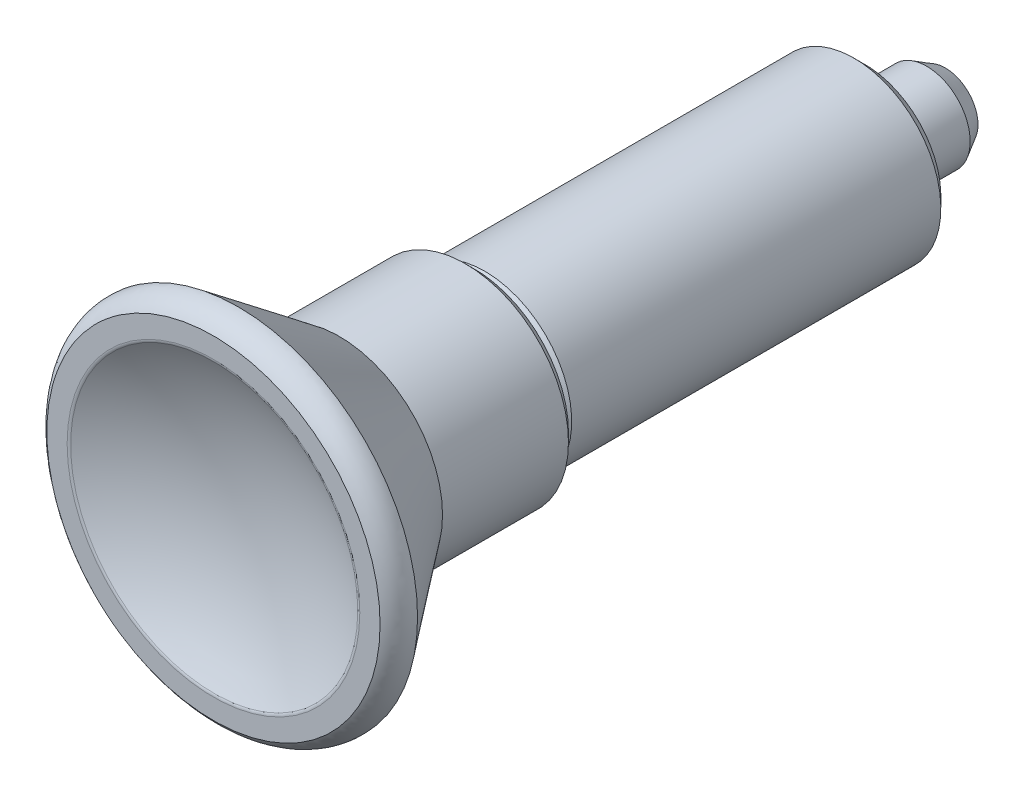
ISO-10303-21;
HEADER;
FILE_DESCRIPTION(('STEP AP214'),'2;1');
FILE_NAME('part.step','',(''),(''),'','','');
FILE_SCHEMA(('AUTOMOTIVE_DESIGN { 1 0 10303 214 1 1 1 1 }'));
ENDSEC;
DATA;
#1=APPLICATION_CONTEXT('core data for automotive mechanical design processes');
#2=APPLICATION_PROTOCOL_DEFINITION('international standard','automotive_design',2000,#1);
#3=PRODUCT_CONTEXT('',#1,'mechanical');
#4=PRODUCT('Part','Part','',(#3));
#5=PRODUCT_RELATED_PRODUCT_CATEGORY('part','',(#4));
#6=PRODUCT_DEFINITION_FORMATION('','',#4);
#7=PRODUCT_DEFINITION_CONTEXT('part definition',#1,'design');
#8=PRODUCT_DEFINITION('design','',#6,#7);
#9=PRODUCT_DEFINITION_SHAPE('','',#8);
#10=(LENGTH_UNIT() NAMED_UNIT(*) SI_UNIT(.MILLI.,.METRE.));
#11=(NAMED_UNIT(*) PLANE_ANGLE_UNIT() SI_UNIT($,.RADIAN.));
#12=(NAMED_UNIT(*) SI_UNIT($,.STERADIAN.) SOLID_ANGLE_UNIT());
#13=UNCERTAINTY_MEASURE_WITH_UNIT(LENGTH_MEASURE(1.E-05),#10,'distance_accuracy_value','');
#14=(GEOMETRIC_REPRESENTATION_CONTEXT(3) GLOBAL_UNCERTAINTY_ASSIGNED_CONTEXT((#13)) GLOBAL_UNIT_ASSIGNED_CONTEXT((#10,
#11,#12)) REPRESENTATION_CONTEXT('',''));
#15=CARTESIAN_POINT('',(0.,0.,0.));
#16=DIRECTION('',(0.,0.,1.));
#17=DIRECTION('',(1.,0.,0.));
#18=AXIS2_PLACEMENT_3D('',#15,#16,#17);
#19=CARTESIAN_POINT('',(4.75462086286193E-11,-3.93907129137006E-10,4.89046303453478E-10));
#20=DIRECTION('',(-0.923728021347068,-0.383049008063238,0.));
#21=DIRECTION('',(0.,0.,-1.));
#22=AXIS2_PLACEMENT_3D('',#19,#20,#21);
#23=SPHERICAL_SURFACE('',#22,8.);
#24=CARTESIAN_POINT('',(0.,0.,-7.41135340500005));
#25=DIRECTION('',(0.,0.,1.));
#26=DIRECTION('',(0.923728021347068,0.383049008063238,0.));
#27=AXIS2_PLACEMENT_3D('',#24,#25,#26);
#28=CIRCLE('',#27,3.011949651);
#29=CARTESIAN_POINT('',(2.78222229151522,1.15372432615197,-7.41135340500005));
#30=VERTEX_POINT('',#29);
#31=EDGE_CURVE('E16',#30,#30,#28,.T.);
#32=ORIENTED_EDGE('',*,*,#31,.F.);
#33=EDGE_LOOP('',(#32));
#34=FACE_BOUND('',#33,.T.);
#35=ADVANCED_FACE('F12',(#34),#23,.T.);
#36=CARTESIAN_POINT('',(0.,0.,-7.41135340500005));
#37=DIRECTION('',(0.,0.,1.));
#38=DIRECTION('',(0.923728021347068,0.383049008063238,0.));
#39=AXIS2_PLACEMENT_3D('',#36,#37,#38);
#40=CONICAL_SURFACE('',#39,3.011949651,0.523598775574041);
#41=ORIENTED_EDGE('',*,*,#31,.T.);
#42=EDGE_LOOP('',(#41));
#43=FACE_BOUND('',#42,.T.);
#44=CARTESIAN_POINT('',(0.,0.,-5.7));
#45=DIRECTION('',(0.,0.,-1.));
#46=DIRECTION('',(-0.923728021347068,-0.383049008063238,0.));
#47=AXIS2_PLACEMENT_3D('',#44,#45,#46);
#48=CIRCLE('',#47,4.);
#49=CARTESIAN_POINT('',(-3.69491208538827,-1.53219603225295,-5.7));
#50=VERTEX_POINT('',#49);
#51=EDGE_CURVE('E29',#50,#50,#48,.F.);
#52=ORIENTED_EDGE('',*,*,#51,.F.);
#53=EDGE_LOOP('',(#52));
#54=FACE_BOUND('',#53,.T.);
#55=ADVANCED_FACE('F83',(#43,#54),#40,.T.);
#56=CARTESIAN_POINT('',(0.,0.,0.));
#57=DIRECTION('',(0.,0.,-1.));
#58=DIRECTION('',(-0.923728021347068,-0.383049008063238,0.));
#59=AXIS2_PLACEMENT_3D('',#56,#57,#58);
#60=CYLINDRICAL_SURFACE('',#59,4.);
#61=CARTESIAN_POINT('',(0.,0.,0.));
#62=DIRECTION('',(0.,0.,-1.));
#63=DIRECTION('',(-0.923728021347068,-0.383049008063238,0.));
#64=AXIS2_PLACEMENT_3D('',#61,#62,#63);
#65=CIRCLE('',#64,4.);
#66=CARTESIAN_POINT('',(-3.69491208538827,-1.53219603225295,0.));
#67=VERTEX_POINT('',#66);
#68=EDGE_CURVE('E33',#67,#67,#65,.F.);
#69=ORIENTED_EDGE('',*,*,#68,.F.);
#70=EDGE_LOOP('',(#69));
#71=FACE_BOUND('',#70,.T.);
#72=ORIENTED_EDGE('',*,*,#51,.T.);
#73=EDGE_LOOP('',(#72));
#74=FACE_BOUND('',#73,.T.);
#75=ADVANCED_FACE('F89',(#71,#74),#60,.T.);
#76=CARTESIAN_POINT('',(9.26654561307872,-3.8526867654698,0.));
#77=DIRECTION('',(0.,0.,-1.));
#78=DIRECTION('',(-0.923728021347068,-0.383049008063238,0.));
#79=AXIS2_PLACEMENT_3D('',#76,#77,#78);
#80=PLANE('',#79);
#81=ORIENTED_EDGE('',*,*,#68,.T.);
#82=EDGE_LOOP('',(#81));
#83=FACE_BOUND('',#82,.T.);
#84=CARTESIAN_POINT('',(0.,0.,0.));
#85=DIRECTION('',(0.,0.,1.));
#86=DIRECTION('',(0.923728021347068,0.383049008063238,0.));
#87=AXIS2_PLACEMENT_3D('',#84,#85,#86);
#88=CIRCLE('',#87,7.);
#89=CARTESIAN_POINT('',(6.46609614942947,2.68134305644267,0.));
#90=VERTEX_POINT('',#89);
#91=EDGE_CURVE('E31',#90,#90,#88,.T.);
#92=ORIENTED_EDGE('',*,*,#91,.F.);
#93=EDGE_LOOP('',(#92));
#94=FACE_BOUND('',#93,.T.);
#95=ADVANCED_FACE('F92',(#83,#94),#80,.T.);
#96=CARTESIAN_POINT('',(0.,0.,0.));
#97=DIRECTION('',(0.,0.,1.));
#98=DIRECTION('',(0.923728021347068,0.383049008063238,0.));
#99=AXIS2_PLACEMENT_3D('',#96,#97,#98);
#100=CONICAL_SURFACE('',#99,7.,0.785398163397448);
#101=CARTESIAN_POINT('',(0.,0.,1.));
#102=DIRECTION('',(0.,0.,-1.));
#103=DIRECTION('',(-0.923728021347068,-0.383049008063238,0.));
#104=AXIS2_PLACEMENT_3D('',#101,#102,#103);
#105=CIRCLE('',#104,8.);
#106=CARTESIAN_POINT('',(-7.38982417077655,-3.0643920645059,0.999999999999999));
#107=VERTEX_POINT('',#106);
#108=EDGE_CURVE('E25',#107,#107,#105,.F.);
#109=ORIENTED_EDGE('',*,*,#108,.F.);
#110=EDGE_LOOP('',(#109));
#111=FACE_BOUND('',#110,.T.);
#112=ORIENTED_EDGE('',*,*,#91,.T.);
#113=EDGE_LOOP('',(#112));
#114=FACE_BOUND('',#113,.T.);
#115=ADVANCED_FACE('F94',(#111,#114),#100,.T.);
#116=CARTESIAN_POINT('',(0.,0.,35.));
#117=DIRECTION('',(0.,0.,-1.));
#118=DIRECTION('',(-0.923728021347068,-0.383049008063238,0.));
#119=AXIS2_PLACEMENT_3D('',#116,#117,#118);
#120=CYLINDRICAL_SURFACE('',#119,8.);
#121=ORIENTED_EDGE('',*,*,#108,.T.);
#122=EDGE_LOOP('',(#121));
#123=FACE_BOUND('',#122,.T.);
#124=CARTESIAN_POINT('',(0.,0.,35.));
#125=DIRECTION('',(0.,0.,-1.));
#126=DIRECTION('',(-0.923728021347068,-0.383049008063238,0.));
#127=AXIS2_PLACEMENT_3D('',#124,#125,#126);
#128=CIRCLE('',#127,8.);
#129=CARTESIAN_POINT('',(-7.38982417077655,-3.0643920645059,35.));
#130=VERTEX_POINT('',#129);
#131=EDGE_CURVE('E20',#130,#130,#128,.F.);
#132=ORIENTED_EDGE('',*,*,#131,.F.);
#133=EDGE_LOOP('',(#132));
#134=FACE_BOUND('',#133,.T.);
#135=ADVANCED_FACE('F97',(#123,#134),#120,.T.);
#136=CARTESIAN_POINT('',(0.,0.,36.));
#137=DIRECTION('',(0.,0.,-1.));
#138=DIRECTION('',(0.383049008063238,-0.923728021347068,0.));
#139=AXIS2_PLACEMENT_3D('',#136,#137,#138);
#140=CONICAL_SURFACE('',#139,7.,0.785398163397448);
#141=ORIENTED_EDGE('',*,*,#131,.T.);
#142=EDGE_LOOP('',(#141));
#143=FACE_BOUND('',#142,.T.);
#144=CARTESIAN_POINT('',(0.,0.,36.));
#145=DIRECTION('',(0.,0.,-1.));
#146=DIRECTION('',(0.383049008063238,-0.923728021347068,0.));
#147=AXIS2_PLACEMENT_3D('',#144,#145,#146);
#148=CIRCLE('',#147,7.);
#149=CARTESIAN_POINT('',(2.68134305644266,-6.46609614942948,36.));
#150=VERTEX_POINT('',#149);
#151=EDGE_CURVE('E8',#150,#150,#148,.T.);
#152=ORIENTED_EDGE('',*,*,#151,.T.);
#153=EDGE_LOOP('',(#152));
#154=FACE_BOUND('',#153,.T.);
#155=ADVANCED_FACE('F101',(#143,#154),#140,.T.);
#156=CARTESIAN_POINT('',(-7.29516712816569E-13,0.,82.3153369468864));
#157=DIRECTION('',(0.,0.,-1.));
#158=DIRECTION('',(1.,0.,0.));
#159=AXIS2_PLACEMENT_3D('',#156,#157,#158);
#160=SPHERICAL_SURFACE('',#159,25.9999999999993);
#161=CARTESIAN_POINT('',(0.,0.,59.9304780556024));
#162=DIRECTION('',(0.,0.,-1.));
#163=DIRECTION('',(1.,0.,0.));
#164=AXIS2_PLACEMENT_3D('',#161,#162,#163);
#165=CIRCLE('',#164,13.2256603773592);
#166=CARTESIAN_POINT('',(13.2256603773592,0.,59.9304780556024));
#167=VERTEX_POINT('',#166);
#168=EDGE_CURVE('E74',#167,#167,#165,.T.);
#169=ORIENTED_EDGE('',*,*,#168,.F.);
#170=EDGE_LOOP('',(#169));
#171=FACE_BOUND('',#170,.T.);
#172=ADVANCED_FACE('F85',(#171),#160,.F.);
#173=CARTESIAN_POINT('',(0.,0.,59.5000000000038));
#174=DIRECTION('',(0.,0.,-1.));
#175=DIRECTION('',(-1.,0.,0.));
#176=AXIS2_PLACEMENT_3D('',#173,#174,#175);
#177=TOROIDAL_SURFACE('',#176,13.4799999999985,0.499999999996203);
#178=ORIENTED_EDGE('',*,*,#168,.T.);
#179=EDGE_LOOP('',(#178));
#180=FACE_BOUND('',#179,.T.);
#181=CARTESIAN_POINT('',(0.,0.,60.));
#182=DIRECTION('',(0.,0.,-1.));
#183=DIRECTION('',(1.,0.,0.));
#184=AXIS2_PLACEMENT_3D('',#181,#182,#183);
#185=CIRCLE('',#184,13.48);
#186=CARTESIAN_POINT('',(13.48,0.,60.));
#187=VERTEX_POINT('',#186);
#188=EDGE_CURVE('E67',#187,#187,#185,.T.);
#189=ORIENTED_EDGE('',*,*,#188,.F.);
#190=EDGE_LOOP('',(#189));
#191=FACE_BOUND('',#190,.T.);
#192=ADVANCED_FACE('F14',(#180,#191),#177,.T.);
#193=CARTESIAN_POINT('',(-16.885,-16.885,60.));
#194=DIRECTION('',(0.,0.,1.));
#195=DIRECTION('',(1.,0.,0.));
#196=AXIS2_PLACEMENT_3D('',#193,#194,#195);
#197=PLANE('',#196);
#198=CARTESIAN_POINT('',(0.,0.,60.));
#199=DIRECTION('',(0.,0.,-1.));
#200=DIRECTION('',(1.,0.,0.));
#201=AXIS2_PLACEMENT_3D('',#198,#199,#200);
#202=CIRCLE('',#201,15.35);
#203=CARTESIAN_POINT('',(15.35,0.,60.));
#204=VERTEX_POINT('',#203);
#205=EDGE_CURVE('E62',#204,#204,#202,.T.);
#206=ORIENTED_EDGE('',*,*,#205,.F.);
#207=EDGE_LOOP('',(#206));
#208=FACE_BOUND('',#207,.T.);
#209=ORIENTED_EDGE('',*,*,#188,.T.);
#210=EDGE_LOOP('',(#209));
#211=FACE_BOUND('',#210,.T.);
#212=ADVANCED_FACE('F151',(#208,#211),#197,.T.);
#213=CARTESIAN_POINT('',(15.35,0.,60.));
#214=CARTESIAN_POINT('',(16.6156543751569,0.,59.1898669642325));
#215=CARTESIAN_POINT('',(16.5,0.,57.7));
#216=CARTESIAN_POINT('',(15.35,-26.5869798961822,60.));
#217=CARTESIAN_POINT('',(16.615654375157,-28.779157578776,59.1898669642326));
#218=CARTESIAN_POINT('',(16.5,-28.5788383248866,57.7));
#219=CARTESIAN_POINT('',(-7.675,-13.2934899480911,60.));
#220=CARTESIAN_POINT('',(-8.30782718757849,-14.389578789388,59.1898669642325));
#221=CARTESIAN_POINT('',(-8.25,-14.2894191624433,57.7));
#222=CARTESIAN_POINT('',(-30.7,0.,60.));
#223=CARTESIAN_POINT('',(-33.2313087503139,0.,59.1898669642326));
#224=CARTESIAN_POINT('',(-33.,0.,57.7));
#225=CARTESIAN_POINT('',(-7.675,13.2934899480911,60.));
#226=CARTESIAN_POINT('',(-8.3078271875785,14.389578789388,59.1898669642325));
#227=CARTESIAN_POINT('',(-8.25,14.2894191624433,57.7));
#228=CARTESIAN_POINT('',(15.35,26.5869798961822,60.));
#229=CARTESIAN_POINT('',(16.6156543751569,28.779157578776,59.1898669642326));
#230=CARTESIAN_POINT('',(16.5,28.5788383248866,57.7));
#231=CARTESIAN_POINT('',(15.35,0.,60.));
#232=CARTESIAN_POINT('',(16.6156543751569,0.,59.1898669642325));
#233=CARTESIAN_POINT('',(16.5,0.,57.7));
#234=(BOUNDED_SURFACE() B_SPLINE_SURFACE(2,2,((#213,#214,#215),(#216,#217,#218),(#219,#220,
#221),(#222,#223,#224),(#225,#226,#227),(#228,#229,#230),(#231,#232,#233)),.UNSPECIFIED.,.T.,
.F.,.F.) B_SPLINE_SURFACE_WITH_KNOTS((3,2,2,3),(3,3),(0.,18.7749492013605,37.5498984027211,
56.3248476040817),(0.,1.),
.UNSPECIFIED.) GEOMETRIC_REPRESENTATION_ITEM() RATIONAL_B_SPLINE_SURFACE(((1.,0.857079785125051,
1.),(0.5,0.428539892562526,0.5),(1.,0.857079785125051,1.),(0.5,0.428539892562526,0.5),(1.,
0.857079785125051,1.),(0.5,0.428539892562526,0.5),(1.,0.857079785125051,1.))) REPRESENTATION_ITEM('') SURFACE());
#235=CARTESIAN_POINT('',(0.,0.,57.7));
#236=DIRECTION('',(0.,0.,1.));
#237=DIRECTION('',(1.,0.,0.));
#238=AXIS2_PLACEMENT_3D('',#235,#236,#237);
#239=CIRCLE('',#238,16.5);
#240=CARTESIAN_POINT('',(16.5,0.,57.7));
#241=VERTEX_POINT('',#240);
#242=EDGE_CURVE('E63',#241,#241,#239,.T.);
#243=CARTESIAN_POINT('',(15.35,0.,60.));
#244=CARTESIAN_POINT('',(15.3556561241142,0.,59.9963795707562));
#245=CARTESIAN_POINT('',(15.3612977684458,0.,59.992736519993));
#246=CARTESIAN_POINT('',(15.3725641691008,0.,59.9853973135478));
#247=CARTESIAN_POINT('',(15.3781888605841,0.,59.9817010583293));
#248=CARTESIAN_POINT('',(15.3894206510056,0.,59.9742554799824));
#249=CARTESIAN_POINT('',(15.395027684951,0.,59.9705060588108));
#250=CARTESIAN_POINT('',(15.4062234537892,0.,59.9629541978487));
#251=CARTESIAN_POINT('',(15.4118121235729,0.,59.9591516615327));
#252=CARTESIAN_POINT('',(15.4229704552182,0.,59.9514936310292));
#253=CARTESIAN_POINT('',(15.4285400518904,0.,59.9476380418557));
#254=CARTESIAN_POINT('',(15.4396595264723,0.,59.9398739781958));
#255=CARTESIAN_POINT('',(15.4452093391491,0.,59.9359654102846));
#256=CARTESIAN_POINT('',(15.4562885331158,0.,59.92809547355));
#257=CARTESIAN_POINT('',(15.4618178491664,0.,59.9241340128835));
#258=CARTESIAN_POINT('',(15.4728553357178,0.,59.9161583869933));
#259=CARTESIAN_POINT('',(15.4783634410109,0.,59.9121441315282));
#260=CARTESIAN_POINT('',(15.489357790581,0.,59.9040630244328));
#261=CARTESIAN_POINT('',(15.4948439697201,0.,59.8999960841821));
#262=CARTESIAN_POINT('',(15.5057937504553,0.,59.8918097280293));
#263=CARTESIAN_POINT('',(15.5112572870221,0.,59.8876902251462));
#264=CARTESIAN_POINT('',(15.5221610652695,0.,59.8793988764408));
#265=CARTESIAN_POINT('',(15.527601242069,0.,59.8752269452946));
#266=CARTESIAN_POINT('',(15.538457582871,0.,59.8668308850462));
#267=CARTESIAN_POINT('',(15.5438736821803,0.,59.8626066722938));
#268=CARTESIAN_POINT('',(15.5546811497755,0.,59.8541062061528));
#269=CARTESIAN_POINT('',(15.5600724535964,0.,59.8498298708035));
#270=CARTESIAN_POINT('',(15.5708296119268,0.,59.8412253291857));
#271=CARTESIAN_POINT('',(15.5761954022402,0.,59.8368970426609));
#272=CARTESIAN_POINT('',(15.5869008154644,0.,59.8281887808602));
#273=CARTESIAN_POINT('',(15.592240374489,0.,59.8238087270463));
#274=CARTESIAN_POINT('',(15.6028926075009,0.,59.814997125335));
#275=CARTESIAN_POINT('',(15.6082052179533,0.,59.810565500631));
#276=CARTESIAN_POINT('',(15.6188028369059,0.,59.801650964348));
#277=CARTESIAN_POINT('',(15.6240877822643,0.,59.7971679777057));
#278=CARTESIAN_POINT('',(15.634629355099,0.,59.7881509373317));
#279=CARTESIAN_POINT('',(15.6398859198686,0.,59.783616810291));
#280=CARTESIAN_POINT('',(15.6503700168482,0.,59.7744977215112));
#281=CARTESIAN_POINT('',(15.655597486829,0.,59.7699126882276));
#282=CARTESIAN_POINT('',(15.6660226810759,0.,59.7606920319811));
#283=CARTESIAN_POINT('',(15.6712203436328,0.,59.7560563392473));
#284=CARTESIAN_POINT('',(15.6815852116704,0.,59.7467346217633));
#285=CARTESIAN_POINT('',(15.6867523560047,0.,59.742048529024));
#286=CARTESIAN_POINT('',(15.6970554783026,0.,59.732626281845));
#287=CARTESIAN_POINT('',(15.7021913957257,0.,59.7278900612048));
#288=CARTESIAN_POINT('',(15.7124313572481,0.,59.7183678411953));
#289=CARTESIAN_POINT('',(15.717535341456,0.,59.71358177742));
#290=CARTESIAN_POINT('',(15.7277107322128,0.,59.7039601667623));
#291=CARTESIAN_POINT('',(15.7327820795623,0.,59.6991245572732));
#292=CARTESIAN_POINT('',(15.7428914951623,0.,59.689404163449));
#293=CARTESIAN_POINT('',(15.7479295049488,0.,59.68451931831));
#294=CARTESIAN_POINT('',(15.7579715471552,0.,59.6747007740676));
#295=CARTESIAN_POINT('',(15.7629755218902,0.,59.6697670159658));
#296=CARTESIAN_POINT('',(15.7729487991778,0.,59.6598509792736));
#297=CARTESIAN_POINT('',(15.7779180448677,0.,59.6548686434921));
#298=CARTESIAN_POINT('',(15.7878211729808,0.,59.6448557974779));
#299=CARTESIAN_POINT('',(15.7927549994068,0.,59.6398252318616));
#300=CARTESIAN_POINT('',(15.8025866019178,0.,59.6297162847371));
#301=CARTESIAN_POINT('',(15.8074843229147,0.,59.6246378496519));
#302=CARTESIAN_POINT('',(15.817243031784,0.,59.6144335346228));
#303=CARTESIAN_POINT('',(15.8221039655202,0.,59.6093076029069));
#304=CARTESIAN_POINT('',(15.8317884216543,0.,59.5990086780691));
#305=CARTESIAN_POINT('',(15.8366118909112,0.,59.593835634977));
#306=CARTESIAN_POINT('',(15.8462207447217,0.,59.5834428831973));
#307=CARTESIAN_POINT('',(15.8510060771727,0.,59.5782231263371));
#308=CARTESIAN_POINT('',(15.8605379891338,0.,59.5677373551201));
#309=CARTESIAN_POINT('',(15.8652845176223,0.,59.5624712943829));
#310=CARTESIAN_POINT('',(15.8747381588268,0.,59.5518933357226));
#311=CARTESIAN_POINT('',(15.8794452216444,0.,59.5465813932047));
#312=CARTESIAN_POINT('',(15.8888192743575,0.,59.535912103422));
#313=CARTESIAN_POINT('',(15.8934862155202,0.,59.5305547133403));
#314=CARTESIAN_POINT('',(15.9027793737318,0.,59.5197949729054));
#315=CARTESIAN_POINT('',(15.9074055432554,0.,59.5143925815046));
#316=CARTESIAN_POINT('',(15.9166165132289,0.,59.5035432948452));
#317=CARTESIAN_POINT('',(15.9212012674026,0.,59.4980963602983));
#318=CARTESIAN_POINT('',(15.9303287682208,0.,59.4871584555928));
#319=CARTESIAN_POINT('',(15.9348714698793,0.,59.4816674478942));
#320=CARTESIAN_POINT('',(15.9439142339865,0.,59.4706418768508));
#321=CARTESIAN_POINT('',(15.9484142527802,0.,59.4651072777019));
#322=CARTESIAN_POINT('',(15.9573710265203,0.,59.4539950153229));
#323=CARTESIAN_POINT('',(15.9618277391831,0.,59.448417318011));
#324=CARTESIAN_POINT('',(15.9706972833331,0.,59.4372193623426));
#325=CARTESIAN_POINT('',(15.9751100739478,0.,59.4315990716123));
#326=CARTESIAN_POINT('',(15.9838911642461,0.,59.4203164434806));
#327=CARTESIAN_POINT('',(15.9882594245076,0.,59.4146540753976));
#328=CARTESIAN_POINT('',(15.9969508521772,0.,59.4032878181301));
#329=CARTESIAN_POINT('',(16.0012739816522,0.,59.3975838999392));
#330=CARTESIAN_POINT('',(16.0098745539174,0.,59.3861350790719));
#331=CARTESIAN_POINT('',(16.0141519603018,0.,59.3803901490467));
#332=CARTESIAN_POINT('',(16.0226605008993,0.,59.3688598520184));
#333=CARTESIAN_POINT('',(16.0268916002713,0.,59.3630744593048));
#334=CARTESIAN_POINT('',(16.035306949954,0.,59.3514637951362));
#335=CARTESIAN_POINT('',(16.0394911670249,0.,59.3456384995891));
#336=CARTESIAN_POINT('',(16.0478121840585,0.,59.3339485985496));
#337=CARTESIAN_POINT('',(16.0519489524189,0.,59.3280839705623));
#338=CARTESIAN_POINT('',(16.0601745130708,0.,59.3163159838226));
#339=CARTESIAN_POINT('',(16.0642632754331,0.,59.3104126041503));
#340=CARTESIAN_POINT('',(16.072392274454,0.,59.2985677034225));
#341=CARTESIAN_POINT('',(16.0764324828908,0.,59.2926261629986));
#342=CARTESIAN_POINT('',(16.0844638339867,0.,59.2807055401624));
#343=CARTESIAN_POINT('',(16.088454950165,0.,59.2747264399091));
#344=CARTESIAN_POINT('',(16.0963875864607,0.,59.2627313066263));
#345=CARTESIAN_POINT('',(16.1003290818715,0.,59.256715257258));
#346=CARTESIAN_POINT('',(16.1081619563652,0.,59.2446468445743));
#347=CARTESIAN_POINT('',(16.1120533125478,0.,59.2385944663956));
#348=CARTESIAN_POINT('',(16.1197853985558,0.,59.2264540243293));
#349=CARTESIAN_POINT('',(16.1236261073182,0.,59.2203659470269));
#350=CARTESIAN_POINT('',(16.131256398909,0.,59.208154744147));
#351=CARTESIAN_POINT('',(16.1350459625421,0.,59.2020316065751));
#352=CARTESIAN_POINT('',(16.1425734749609,0.,59.189750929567));
#353=CARTESIAN_POINT('',(16.1463114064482,0.,59.1835933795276));
#354=CARTESIAN_POINT('',(16.15373517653,0.,59.1712445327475));
#355=CARTESIAN_POINT('',(16.1574209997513,0.,59.1650532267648));
#356=CARTESIAN_POINT('',(16.1647400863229,0.,59.1526375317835));
#357=CARTESIAN_POINT('',(16.1683733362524,0.,59.1464131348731));
#358=CARTESIAN_POINT('',(16.175586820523,0.,59.1339319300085));
#359=CARTESIAN_POINT('',(16.1791670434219,0.,59.1276751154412));
#360=CARTESIAN_POINT('',(16.1862740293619,0.,59.1151297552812));
#361=CARTESIAN_POINT('',(16.1898007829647,0.,59.1088412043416));
#362=CARTESIAN_POINT('',(16.196800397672,0.,59.0962330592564));
#363=CARTESIAN_POINT('',(16.2002732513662,0.,59.0899134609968));
#364=CARTESIAN_POINT('',(16.2071646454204,0.,59.0772439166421));
#365=CARTESIAN_POINT('',(16.210583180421,0.,59.0708939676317));
#366=CARTESIAN_POINT('',(16.2173655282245,0.,59.0581644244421));
#367=CARTESIAN_POINT('',(16.2207293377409,0.,59.0517848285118));
#368=CARTESIAN_POINT('',(16.2274018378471,0.,59.038996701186));
#369=CARTESIAN_POINT('',(16.2307105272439,0.,59.032588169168));
#370=CARTESIAN_POINT('',(16.237272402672,0.,59.0197428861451));
#371=CARTESIAN_POINT('',(16.2405255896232,0.,59.01330613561));
#372=CARTESIAN_POINT('',(16.2469760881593,0.,59.0004051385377));
#373=CARTESIAN_POINT('',(16.2501734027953,0.,58.993940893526));
#374=CARTESIAN_POINT('',(16.2565117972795,0.,58.9809856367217));
#375=CARTESIAN_POINT('',(16.2596528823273,0.,58.9744946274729));
#376=CARTESIAN_POINT('',(16.2658784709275,0.,58.9614865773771));
#377=CARTESIAN_POINT('',(16.2689629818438,0.,58.9549695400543));
#378=CARTESIAN_POINT('',(16.275075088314,0.,58.9419101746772));
#379=CARTESIAN_POINT('',(16.2781026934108,0.,58.9353678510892));
#380=CARTESIAN_POINT('',(16.2841006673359,0.,58.9222586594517));
#381=CARTESIAN_POINT('',(16.2870710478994,0.,58.9156917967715));
#382=CARTESIAN_POINT('',(16.2929542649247,0.,58.9025342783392));
#383=CARTESIAN_POINT('',(16.2958671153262,0.,58.89594362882));
#384=CARTESIAN_POINT('',(16.3016349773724,0.,58.8827392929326));
#385=CARTESIAN_POINT('',(16.3044900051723,0.,58.8761256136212));
#386=CARTESIAN_POINT('',(16.3101419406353,0.,58.8628759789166));
#387=CARTESIAN_POINT('',(16.3129388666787,0.,58.856240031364));
#388=CARTESIAN_POINT('',(16.3184743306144,0.,58.8429466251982));
#389=CARTESIAN_POINT('',(16.3212128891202,0.,58.8362891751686));
#390=CARTESIAN_POINT('',(16.3266313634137,0.,58.8229535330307));
#391=CARTESIAN_POINT('',(16.3293113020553,0.,58.8162753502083));
#392=CARTESIAN_POINT('',(16.3346122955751,0.,58.8028990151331));
#393=CARTESIAN_POINT('',(16.3372333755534,0.,58.7962008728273));
#394=CARTESIAN_POINT('',(16.3424164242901,0.,58.7827853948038));
#395=CARTESIAN_POINT('',(16.3449784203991,0.,58.7760680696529));
#396=CARTESIAN_POINT('',(16.3500430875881,0.,58.7626150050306));
#397=CARTESIAN_POINT('',(16.3525457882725,0.,58.7558792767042));
#398=CARTESIAN_POINT('',(16.357491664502,0.,58.7423901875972));
#399=CARTESIAN_POINT('',(16.3599348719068,0.,58.7356368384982));
#400=CARTESIAN_POINT('',(16.364761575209,0.,58.7221132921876));
#401=CARTESIAN_POINT('',(16.367145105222,0.,58.7153431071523));
#402=CARTESIAN_POINT('',(16.3718522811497,0.,58.7017866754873));
#403=CARTESIAN_POINT('',(16.3741759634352,0.,58.6950004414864));
#404=CARTESIAN_POINT('',(16.3787632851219,0.,58.6814127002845));
#405=CARTESIAN_POINT('',(16.3810269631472,0.,58.6746112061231));
#406=CARTESIAN_POINT('',(16.3854941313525,0.,58.6609937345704));
#407=CARTESIAN_POINT('',(16.3876976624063,0.,58.6541777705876));
#408=CARTESIAN_POINT('',(16.3920444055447,0.,58.6405321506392));
#409=CARTESIAN_POINT('',(16.3941876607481,0.,58.6337025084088));
#410=CARTESIAN_POINT('',(16.3984137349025,0.,58.6200303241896));
#411=CARTESIAN_POINT('',(16.4004965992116,0.,58.6131877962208));
#412=CARTESIAN_POINT('',(16.404601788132,0.,58.5994906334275));
#413=CARTESIAN_POINT('',(16.4066241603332,0.,58.5926360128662));
#414=CARTESIAN_POINT('',(16.4106082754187,0.,58.5789154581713));
#415=CARTESIAN_POINT('',(16.4125700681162,0.,58.5720495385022));
#416=CARTESIAN_POINT('',(16.4164329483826,0.,58.5583071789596));
#417=CARTESIAN_POINT('',(16.4183340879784,0.,58.5514307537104));
#418=CARTESIAN_POINT('',(16.4220756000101,0.,58.5376681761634));
#419=CARTESIAN_POINT('',(16.4239160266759,0.,58.5307820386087));
#420=CARTESIAN_POINT('',(16.4275360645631,0.,58.5170008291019));
#421=CARTESIAN_POINT('',(16.429315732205,0.,58.5101057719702));
#422=CARTESIAN_POINT('',(16.4328142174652,0.,58.4963075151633));
#423=CARTESIAN_POINT('',(16.4345330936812,0.,58.4894043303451));
#424=CARTESIAN_POINT('',(16.4379099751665,0.,58.4755906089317));
#425=CARTESIAN_POINT('',(16.4395680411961,0.,58.4686800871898));
#426=CARTESIAN_POINT('',(16.4428232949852,0.,58.4548524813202));
#427=CARTESIAN_POINT('',(16.4444205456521,0.,58.447935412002));
#428=CARTESIAN_POINT('',(16.4475541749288,0.,58.4340954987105));
#429=CARTESIAN_POINT('',(16.4490906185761,0.,58.4271726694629));
#430=CARTESIAN_POINT('',(16.4521026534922,0.,58.4133220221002));
#431=CARTESIAN_POINT('',(16.4535783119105,0.,58.4063942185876));
#432=CARTESIAN_POINT('',(16.4564688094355,0.,58.3925344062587));
#433=CARTESIAN_POINT('',(16.4578837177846,0.,58.385602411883));
#434=CARTESIAN_POINT('',(16.4606527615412,0.,58.3717349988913));
#435=CARTESIAN_POINT('',(16.4620069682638,0.,58.3647995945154));
#436=CARTESIAN_POINT('',(16.4646546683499,0.,58.3509261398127));
#437=CARTESIAN_POINT('',(16.4659482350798,0.,58.3439881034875));
#438=CARTESIAN_POINT('',(16.4684747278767,0.,58.3301101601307));
#439=CARTESIAN_POINT('',(16.4697077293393,0.,58.3231702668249));
#440=CARTESIAN_POINT('',(16.4721131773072,0.,58.3092893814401));
#441=CARTESIAN_POINT('',(16.4732857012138,0.,58.3023484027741));
#442=CARTESIAN_POINT('',(16.4755702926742,0.,58.2884661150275));
#443=CARTESIAN_POINT('',(16.4766824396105,0.,58.2815248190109));
#444=CARTESIAN_POINT('',(16.4788463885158,0.,58.2676426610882));
#445=CARTESIAN_POINT('',(16.4798982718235,0.,58.2607018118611));
#446=CARTESIAN_POINT('',(16.4819418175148,0.,58.2468213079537));
#447=CARTESIAN_POINT('',(16.4829335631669,0.,58.2398816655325));
#448=CARTESIAN_POINT('',(16.4848569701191,0.,58.2260043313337));
#449=CARTESIAN_POINT('',(16.4857887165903,0.,58.2190666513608));
#450=CARTESIAN_POINT('',(16.487592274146,0.,58.2051939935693));
#451=CARTESIAN_POINT('',(16.4884641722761,0.,58.1982590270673));
#452=CARTESIAN_POINT('',(16.4901481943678,0.,58.1843925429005));
#453=CARTESIAN_POINT('',(16.4909604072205,0.,58.1774610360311));
#454=CARTESIAN_POINT('',(16.4925252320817,0.,58.1636022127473));
#455=CARTESIAN_POINT('',(16.4932779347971,0.,58.1566749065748));
#456=CARTESIAN_POINT('',(16.4947239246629,0.,58.1428252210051));
#457=CARTESIAN_POINT('',(16.4954173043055,0.,58.1359028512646));
#458=CARTESIAN_POINT('',(16.4967448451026,0.,58.1220637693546));
#459=CARTESIAN_POINT('',(16.4973791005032,0.,58.1151470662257));
#460=CARTESIAN_POINT('',(16.4985886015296,0.,58.101320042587));
#461=CARTESIAN_POINT('',(16.4991639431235,0.,58.0944097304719));
#462=CARTESIAN_POINT('',(16.5002558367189,0.,58.0805962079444));
#463=CARTESIAN_POINT('',(16.5007724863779,0.,58.0736930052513));
#464=CARTESIAN_POINT('',(16.5017472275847,0.,58.0598944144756));
#465=CARTESIAN_POINT('',(16.5022054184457,0.,58.0529990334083));
#466=CARTESIAN_POINT('',(16.5030634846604,0.,58.0392167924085));
#467=CARTESIAN_POINT('',(16.503463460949,0.,58.0323299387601));
#468=CARTESIAN_POINT('',(16.5042053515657,0.,58.0185654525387));
#469=CARTESIAN_POINT('',(16.5045473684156,0.,58.0116878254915));
#470=CARTESIAN_POINT('',(16.5051736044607,0.,57.9979424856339));
#471=CARTESIAN_POINT('',(16.5054579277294,0.,57.9910747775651));
#472=CARTESIAN_POINT('',(16.5059690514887,0.,57.9773499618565));
#473=CARTESIAN_POINT('',(16.5061959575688,0.,57.9704928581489));
#474=CARTESIAN_POINT('',(16.5065925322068,0.,57.9567899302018));
#475=CARTESIAN_POINT('',(16.506762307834,0.,57.9499441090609));
#476=CARTESIAN_POINT('',(16.5070449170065,0.,57.9362644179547));
#477=CARTESIAN_POINT('',(16.507157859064,0.,57.9294305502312));
#478=CARTESIAN_POINT('',(16.5073271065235,0.,57.9157754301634));
#479=CARTESIAN_POINT('',(16.5073835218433,0.,57.9089541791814));
#480=CARTESIAN_POINT('',(16.5074400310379,0.,57.8953249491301));
#481=CARTESIAN_POINT('',(16.5074402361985,0.,57.8885169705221));
#482=CARTESIAN_POINT('',(16.5073846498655,0.,57.874914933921));
#483=CARTESIAN_POINT('',(16.5073289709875,0.,57.8681208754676));
#484=CARTESIAN_POINT('',(16.5071619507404,0.,57.8545473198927));
#485=CARTESIAN_POINT('',(16.5070507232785,0.,57.8477678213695));
#486=CARTESIAN_POINT('',(16.5067729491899,0.,57.8342240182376));
#487=CARTESIAN_POINT('',(16.5066065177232,0.,57.827459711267));
#488=CARTESIAN_POINT('',(16.5062186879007,0.,57.8139469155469));
#489=CARTESIAN_POINT('',(16.5059974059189,0.,57.8071984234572));
#490=CARTESIAN_POINT('',(16.5055002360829,0.,57.7937178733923));
#491=CARTESIAN_POINT('',(16.5052244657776,0.,57.7869858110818));
#492=CARTESIAN_POINT('',(16.5046186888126,0.,57.7735387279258));
#493=CARTESIAN_POINT('',(16.504288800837,0.,57.7668237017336));
#494=CARTESIAN_POINT('',(16.503575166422,0.,57.7534112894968));
#495=CARTESIAN_POINT('',(16.503191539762,0.,57.7467138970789));
#496=CARTESIAN_POINT('',(16.5023708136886,0.,57.7333373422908));
#497=CARTESIAN_POINT('',(16.5019338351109,0.,57.7266581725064));
#498=CARTESIAN_POINT('',(16.5010067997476,0.,57.713318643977));
#499=CARTESIAN_POINT('',(16.5005168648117,0.,57.7066582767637));
#500=CARTESIAN_POINT('',(16.5,0.,57.7));
#501=B_SPLINE_CURVE_WITH_KNOTS('',3,(#243,#244,#245,#246,#247,#248,#249,#250,#251,#252,#253,
#254,#255,#256,#257,#258,#259,#260,#261,#262,#263,#264,#265,#266,#267,#268,#269,#270,#271,#272,
#273,#274,#275,#276,#277,#278,#279,#280,#281,#282,#283,#284,#285,#286,#287,#288,#289,#290,#291,
#292,#293,#294,#295,#296,#297,#298,#299,#300,#301,#302,#303,#304,#305,#306,#307,#308,#309,#310,
#311,#312,#313,#314,#315,#316,#317,#318,#319,#320,#321,#322,#323,#324,#325,#326,#327,#328,#329,
#330,#331,#332,#333,#334,#335,#336,#337,#338,#339,#340,#341,#342,#343,#344,#345,#346,#347,#348,
#349,#350,#351,#352,#353,#354,#355,#356,#357,#358,#359,#360,#361,#362,#363,#364,#365,#366,#367,
#368,#369,#370,#371,#372,#373,#374,#375,#376,#377,#378,#379,#380,#381,#382,#383,#384,#385,#386,
#387,#388,#389,#390,#391,#392,#393,#394,#395,#396,#397,#398,#399,#400,#401,#402,#403,#404,#405,
#406,#407,#408,#409,#410,#411,#412,#413,#414,#415,#416,#417,#418,#419,#420,#421,#422,#423,#424,
#425,#426,#427,#428,#429,#430,#431,#432,#433,#434,#435,#436,#437,#438,#439,#440,#441,#442,#443,
#444,#445,#446,#447,#448,#449,#450,#451,#452,#453,#454,#455,#456,#457,#458,#459,#460,#461,#462,
#463,#464,#465,#466,#467,#468,#469,#470,#471,#472,#473,#474,#475,#476,#477,#478,#479,#480,#481,
#482,#483,#484,#485,#486,#487,#488,#489,#490,#491,#492,#493,#494,#495,#496,#497,#498,#499,#500),
.UNSPECIFIED.,.F.,.F.,(4,2,2,2,2,2,2,2,2,2,2,2,2,2,2,2,2,2,2,2,2,2,2,2,2,2,2,2,2,2,2,2,2,2,2,2,
2,2,2,2,2,2,2,2,2,2,2,2,2,2,2,2,2,2,2,2,2,2,2,2,2,2,2,2,2,2,2,2,2,2,2,2,2,2,2,2,2,2,2,2,2,2,2,2,
2,2,2,2,2,2,2,2,2,2,2,2,2,2,2,2,2,2,2,2,2,2,2,2,2,2,2,2,2,2,2,2,2,2,2,2,2,2,2,2,2,2,2,2,4),(0.,
0.020146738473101,0.0403379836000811,0.0605732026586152,0.0808518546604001,0.101173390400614,
0.121537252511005,0.141942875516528,0.162389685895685,0.182877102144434,0.203404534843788,
0.223971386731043,0.244577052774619,0.26522092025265,0.28590236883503,0.306620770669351,
0.327375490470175,0.348165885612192,0.368991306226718,0.38985109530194,0.410744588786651,
0.431671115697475,0.452629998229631,0.473620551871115,0.494642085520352,0.515693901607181,
0.536775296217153,0.557885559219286,0.579023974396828,0.600189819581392,0.62138236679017,
0.642600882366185,0.663844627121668,0.685112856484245,0.706404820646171,0.727719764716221,
0.749056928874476,0.77041554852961,0.791794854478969,0.813194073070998,0.834612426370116,
0.856049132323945,0.877503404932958,0.898974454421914,0.920461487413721,0.941963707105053,
0.963480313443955,0.985010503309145,1.00655347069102,1.02810840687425,1.04967450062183,
1.07125093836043,1.09283690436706,1.11443158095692,1.13603414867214,1.15764378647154,
1.17925967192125,1.20088098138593,1.22250689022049,1.24413657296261,1.26576920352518,
1.28740395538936,1.30904000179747,1.33067651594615,1.35231267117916,1.37394764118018,
1.39558060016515,1.4172107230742,1.43883718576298,1.46045916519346,1.48207583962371,
1.50368638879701,1.52528999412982,1.54688583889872,1.56847310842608,1.59005099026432,
1.61161867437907,1.63317535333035,1.65472022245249,1.67625248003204,1.69777132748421,
1.71927596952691,1.74076561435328,1.76223947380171,1.78369676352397,1.80513670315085,
1.82655851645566,1.84796143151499,1.86934468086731,1.89070750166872,1.9120491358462,
1.93336883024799,1.95466583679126,1.97593941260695,1.99718882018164,2.01841332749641,
2.03961220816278,2.0607847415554,2.08193021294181,2.10304791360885,2.12413714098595,
2.14519719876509,2.16622739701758,2.18722705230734,2.20819548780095,2.22913203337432,
2.25003602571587,2.2709068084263,2.29174373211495,2.31254615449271,2.33331344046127,
2.3540449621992,2.37474009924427,2.3953982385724,2.416018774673,2.43660110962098,
2.45714465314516,2.47764882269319,2.49811304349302,2.5185367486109,2.53891937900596,
2.55926038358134,2.57955921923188,2.59981535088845,2.62002825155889,2.64019740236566,
2.66032229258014,2.68040241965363,2.7004372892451),.UNSPECIFIED.);
#502=EDGE_CURVE('BSEAM161',#204,#241,#501,.T.);
#503=ORIENTED_EDGE('',*,*,#205,.T.);
#504=ORIENTED_EDGE('',*,*,#242,.T.);
#505=ORIENTED_EDGE('',*,*,#502,.T.);
#506=ORIENTED_EDGE('',*,*,#502,.F.);
#507=EDGE_LOOP('',(#503,#505,#504,#506));
#508=FACE_BOUND('',#507,.T.);
#509=ADVANCED_FACE('F161',(#508),#234,.T.);
#510=CARTESIAN_POINT('',(0.,0.,48.4));
#511=DIRECTION('',(0.,0.,1.));
#512=DIRECTION('',(1.,0.,0.));
#513=AXIS2_PLACEMENT_3D('',#510,#511,#512);
#514=CONICAL_SURFACE('',#513,9.5,0.645219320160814);
#515=ORIENTED_EDGE('',*,*,#242,.F.);
#516=EDGE_LOOP('',(#515));
#517=FACE_BOUND('',#516,.T.);
#518=CARTESIAN_POINT('',(0.,0.,48.4));
#519=DIRECTION('',(0.,0.,-1.));
#520=DIRECTION('',(1.,0.,0.));
#521=AXIS2_PLACEMENT_3D('',#518,#519,#520);
#522=CIRCLE('',#521,9.5);
#523=CARTESIAN_POINT('',(9.49999999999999,0.,48.4));
#524=VERTEX_POINT('',#523);
#525=EDGE_CURVE('E56',#524,#524,#522,.T.);
#526=ORIENTED_EDGE('',*,*,#525,.F.);
#527=EDGE_LOOP('',(#526));
#528=FACE_BOUND('',#527,.T.);
#529=ADVANCED_FACE('F168',(#517,#528),#514,.T.);
#530=CARTESIAN_POINT('',(0.,0.,48.4));
#531=DIRECTION('',(0.,0.,-1.));
#532=DIRECTION('',(1.,0.,0.));
#533=AXIS2_PLACEMENT_3D('',#530,#531,#532);
#534=CYLINDRICAL_SURFACE('',#533,9.5);
#535=CARTESIAN_POINT('',(0.,0.,36.8));
#536=DIRECTION('',(0.,0.,1.));
#537=DIRECTION('',(1.,0.,0.));
#538=AXIS2_PLACEMENT_3D('',#535,#536,#537);
#539=CIRCLE('',#538,9.5);
#540=CARTESIAN_POINT('',(9.49999999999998,0.,36.8));
#541=VERTEX_POINT('',#540);
#542=EDGE_CURVE('E46',#541,#541,#539,.T.);
#543=ORIENTED_EDGE('',*,*,#542,.T.);
#544=EDGE_LOOP('',(#543));
#545=FACE_BOUND('',#544,.T.);
#546=ORIENTED_EDGE('',*,*,#525,.T.);
#547=EDGE_LOOP('',(#546));
#548=FACE_BOUND('',#547,.T.);
#549=ADVANCED_FACE('F177',(#545,#548),#534,.T.);
#550=CARTESIAN_POINT('',(0.,0.,36.));
#551=DIRECTION('',(0.,0.,1.));
#552=DIRECTION('',(1.,0.,0.));
#553=AXIS2_PLACEMENT_3D('',#550,#551,#552);
#554=CONICAL_SURFACE('',#553,8.7,0.785398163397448);
#555=ORIENTED_EDGE('',*,*,#542,.F.);
#556=EDGE_LOOP('',(#555));
#557=FACE_BOUND('',#556,.T.);
#558=CARTESIAN_POINT('',(0.,0.,36.));
#559=DIRECTION('',(0.,0.,-1.));
#560=DIRECTION('',(1.,0.,0.));
#561=AXIS2_PLACEMENT_3D('',#558,#559,#560);
#562=CIRCLE('',#561,8.7);
#563=CARTESIAN_POINT('',(8.69999999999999,0.,36.));
#564=VERTEX_POINT('',#563);
#565=EDGE_CURVE('E41',#564,#564,#562,.T.);
#566=ORIENTED_EDGE('',*,*,#565,.F.);
#567=EDGE_LOOP('',(#566));
#568=FACE_BOUND('',#567,.T.);
#569=ADVANCED_FACE('F186',(#557,#568),#554,.T.);
#570=CARTESIAN_POINT('',(-10.45,10.45,36.));
#571=DIRECTION('',(0.,0.,-1.));
#572=DIRECTION('',(1.,0.,0.));
#573=AXIS2_PLACEMENT_3D('',#570,#571,#572);
#574=PLANE('',#573);
#575=ORIENTED_EDGE('',*,*,#565,.T.);
#576=EDGE_LOOP('',(#575));
#577=FACE_BOUND('',#576,.T.);
#578=ORIENTED_EDGE('',*,*,#151,.F.);
#579=EDGE_LOOP('',(#578));
#580=FACE_BOUND('',#579,.T.);
#581=ADVANCED_FACE('F195',(#577,#580),#574,.T.);
#582=CLOSED_SHELL('',(#35,#55,#75,#95,#115,#135,#155,#172,#192,#212,#509,#529,#549,#569,#581));
#583=MANIFOLD_SOLID_BREP('B1',#582);
#584=ADVANCED_BREP_SHAPE_REPRESENTATION('',(#18,#583),#14);
#585=SHAPE_DEFINITION_REPRESENTATION(#9,#584);
ENDSEC;
END-ISO-10303-21;
